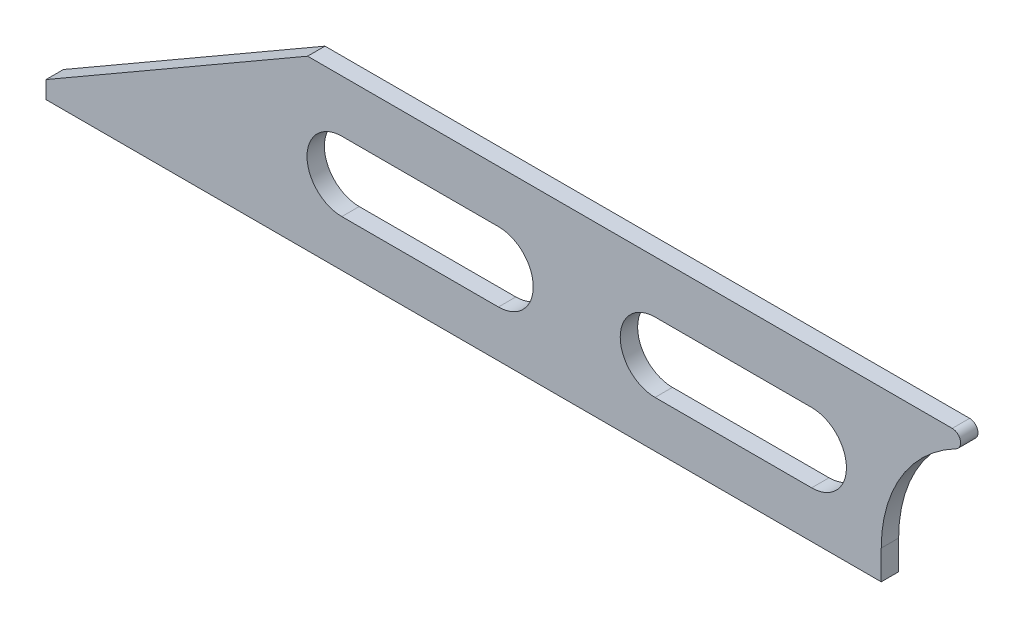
ISO-10303-21;
HEADER;
FILE_DESCRIPTION(('STEP AP214'),'2;1');
FILE_NAME('part.step','',(''),(''),'','','');
FILE_SCHEMA(('AUTOMOTIVE_DESIGN { 1 0 10303 214 1 1 1 1 }'));
ENDSEC;
DATA;
#1=APPLICATION_CONTEXT('core data for automotive mechanical design processes');
#2=APPLICATION_PROTOCOL_DEFINITION('international standard','automotive_design',2000,#1);
#3=PRODUCT_CONTEXT('',#1,'mechanical');
#4=PRODUCT('Part','Part','',(#3));
#5=PRODUCT_RELATED_PRODUCT_CATEGORY('part','',(#4));
#6=PRODUCT_DEFINITION_FORMATION('','',#4);
#7=PRODUCT_DEFINITION_CONTEXT('part definition',#1,'design');
#8=PRODUCT_DEFINITION('design','',#6,#7);
#9=PRODUCT_DEFINITION_SHAPE('','',#8);
#10=(LENGTH_UNIT() NAMED_UNIT(*) SI_UNIT(.MILLI.,.METRE.));
#11=(NAMED_UNIT(*) PLANE_ANGLE_UNIT() SI_UNIT($,.RADIAN.));
#12=(NAMED_UNIT(*) SI_UNIT($,.STERADIAN.) SOLID_ANGLE_UNIT());
#13=UNCERTAINTY_MEASURE_WITH_UNIT(LENGTH_MEASURE(1.E-05),#10,'distance_accuracy_value','');
#14=(GEOMETRIC_REPRESENTATION_CONTEXT(3) GLOBAL_UNCERTAINTY_ASSIGNED_CONTEXT((#13)) GLOBAL_UNIT_ASSIGNED_CONTEXT((#10,
#11,#12)) REPRESENTATION_CONTEXT('',''));
#15=CARTESIAN_POINT('',(0.,0.,0.));
#16=DIRECTION('',(0.,0.,1.));
#17=DIRECTION('',(1.,0.,0.));
#18=AXIS2_PLACEMENT_3D('',#15,#16,#17);
#19=CARTESIAN_POINT('',(304.8,61.4680000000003,3.17500000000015));
#20=DIRECTION('',(-1.,0.,0.));
#21=DIRECTION('',(0.,0.,1.));
#22=AXIS2_PLACEMENT_3D('',#19,#20,#21);
#23=PLANE('',#22);
#24=DIRECTION('',(0.,0.,1.));
#25=VECTOR('',#24,1.);
#26=CARTESIAN_POINT('',(304.799999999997,10.6680000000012,-75.0170489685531));
#27=LINE('',#26,#25);
#28=CARTESIAN_POINT('',(304.8,10.6680000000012,-3.17499999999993));
#29=VERTEX_POINT('',#28);
#30=CARTESIAN_POINT('',(304.8,10.6680000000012,3.17500000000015));
#31=VERTEX_POINT('',#30);
#32=EDGE_CURVE('E256',#29,#31,#27,.T.);
#33=ORIENTED_EDGE('',*,*,#32,.T.);
#34=DIRECTION('',(0.,1.,0.));
#35=VECTOR('',#34,1.);
#36=CARTESIAN_POINT('',(304.8,61.4680000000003,3.17500000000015));
#37=LINE('',#36,#35);
#38=CARTESIAN_POINT('',(304.8,4.44089209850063E-13,3.17500000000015));
#39=VERTEX_POINT('',#38);
#40=EDGE_CURVE('E220',#39,#31,#37,.T.);
#41=ORIENTED_EDGE('',*,*,#40,.F.);
#42=DIRECTION('',(0.,0.,-1.));
#43=VECTOR('',#42,1.);
#44=CARTESIAN_POINT('',(304.8,4.44089209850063E-13,3.17500000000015));
#45=LINE('',#44,#43);
#46=CARTESIAN_POINT('',(304.8,4.44089209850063E-13,-3.17499999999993));
#47=VERTEX_POINT('',#46);
#48=EDGE_CURVE('E238',#39,#47,#45,.T.);
#49=ORIENTED_EDGE('',*,*,#48,.T.);
#50=DIRECTION('',(0.,1.,0.));
#51=VECTOR('',#50,1.);
#52=CARTESIAN_POINT('',(304.8,61.4680000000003,-3.17499999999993));
#53=LINE('',#52,#51);
#54=EDGE_CURVE('E209',#47,#29,#53,.T.);
#55=ORIENTED_EDGE('',*,*,#54,.T.);
#56=EDGE_LOOP('',(#33,#41,#49,#55));
#57=FACE_BOUND('',#56,.T.);
#58=ADVANCED_FACE('F26',(#57),#23,.F.);
#59=CARTESIAN_POINT('',(304.8,4.44089209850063E-13,3.17500000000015));
#60=DIRECTION('',(0.,1.,0.));
#61=DIRECTION('',(-1.,0.,0.));
#62=AXIS2_PLACEMENT_3D('',#59,#60,#61);
#63=PLANE('',#62);
#64=DIRECTION('',(1.,0.,0.));
#65=VECTOR('',#64,1.);
#66=CARTESIAN_POINT('',(304.8,4.44089209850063E-13,-3.17499999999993));
#67=LINE('',#66,#65);
#68=CARTESIAN_POINT('',(0.,0.,-3.17499999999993));
#69=VERTEX_POINT('',#68);
#70=EDGE_CURVE('E200',#69,#47,#67,.T.);
#71=ORIENTED_EDGE('',*,*,#70,.T.);
#72=ORIENTED_EDGE('',*,*,#48,.F.);
#73=DIRECTION('',(1.,0.,0.));
#74=VECTOR('',#73,1.);
#75=CARTESIAN_POINT('',(304.8,4.44089209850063E-13,3.17500000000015));
#76=LINE('',#75,#74);
#77=CARTESIAN_POINT('',(0.,0.,3.17499999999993));
#78=VERTEX_POINT('',#77);
#79=EDGE_CURVE('E217',#78,#39,#76,.T.);
#80=ORIENTED_EDGE('',*,*,#79,.F.);
#81=DIRECTION('',(0.,0.,-1.));
#82=VECTOR('',#81,1.);
#83=CARTESIAN_POINT('',(0.,0.,3.17499999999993));
#84=LINE('',#83,#82);
#85=EDGE_CURVE('E229',#78,#69,#84,.T.);
#86=ORIENTED_EDGE('',*,*,#85,.T.);
#87=EDGE_LOOP('',(#71,#72,#80,#86));
#88=FACE_BOUND('',#87,.T.);
#89=ADVANCED_FACE('F28',(#88),#63,.F.);
#90=CARTESIAN_POINT('',(95.4671764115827,61.4680000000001,3.17500000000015));
#91=DIRECTION('',(0.,-1.,0.));
#92=DIRECTION('',(0.,0.,-1.));
#93=AXIS2_PLACEMENT_3D('',#90,#91,#92);
#94=PLANE('',#93);
#95=DIRECTION('',(-1.,0.,0.));
#96=VECTOR('',#95,1.);
#97=CARTESIAN_POINT('',(95.4671764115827,61.4680000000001,3.17500000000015));
#98=LINE('',#97,#96);
#99=CARTESIAN_POINT('',(330.713184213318,61.4680000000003,3.17499999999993));
#100=VERTEX_POINT('',#99);
#101=CARTESIAN_POINT('',(95.4671764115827,61.4680000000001,3.17500000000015));
#102=VERTEX_POINT('',#101);
#103=EDGE_CURVE('E223',#100,#102,#98,.T.);
#104=ORIENTED_EDGE('',*,*,#103,.F.);
#105=DIRECTION('',(0.,0.,-1.));
#106=VECTOR('',#105,1.);
#107=CARTESIAN_POINT('',(330.713184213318,61.4680000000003,-3.17499999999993));
#108=LINE('',#107,#106);
#109=CARTESIAN_POINT('',(330.713184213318,61.4680000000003,-3.17499999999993));
#110=VERTEX_POINT('',#109);
#111=EDGE_CURVE('E34',#100,#110,#108,.T.);
#112=ORIENTED_EDGE('',*,*,#111,.T.);
#113=DIRECTION('',(-1.,0.,0.));
#114=VECTOR('',#113,1.);
#115=CARTESIAN_POINT('',(95.4671764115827,61.4680000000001,-3.17499999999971));
#116=LINE('',#115,#114);
#117=CARTESIAN_POINT('',(95.4671764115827,61.4680000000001,-3.17499999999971));
#118=VERTEX_POINT('',#117);
#119=EDGE_CURVE('E211',#110,#118,#116,.T.);
#120=ORIENTED_EDGE('',*,*,#119,.T.);
#121=DIRECTION('',(0.,0.,-1.));
#122=VECTOR('',#121,1.);
#123=CARTESIAN_POINT('',(95.4671764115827,61.4680000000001,3.17500000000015));
#124=LINE('',#123,#122);
#125=EDGE_CURVE('E235',#102,#118,#124,.T.);
#126=ORIENTED_EDGE('',*,*,#125,.F.);
#127=EDGE_LOOP('',(#104,#112,#120,#126));
#128=FACE_BOUND('',#127,.T.);
#129=ADVANCED_FACE('F288',(#128),#94,.F.);
#130=CARTESIAN_POINT('',(0.,6.35000000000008,3.17499999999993));
#131=DIRECTION('',(0.499999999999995,-0.866025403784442,0.));
#132=DIRECTION('',(0.866025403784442,0.499999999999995,0.));
#133=AXIS2_PLACEMENT_3D('',#130,#131,#132);
#134=PLANE('',#133);
#135=DIRECTION('',(-0.866025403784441,-0.499999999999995,0.));
#136=VECTOR('',#135,1.);
#137=CARTESIAN_POINT('',(0.,6.35000000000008,-3.17500000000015));
#138=LINE('',#137,#136);
#139=CARTESIAN_POINT('',(0.,6.35000000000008,-3.17500000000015));
#140=VERTEX_POINT('',#139);
#141=EDGE_CURVE('E213',#118,#140,#138,.T.);
#142=ORIENTED_EDGE('',*,*,#141,.T.);
#143=DIRECTION('',(0.,0.,-1.));
#144=VECTOR('',#143,1.);
#145=CARTESIAN_POINT('',(0.,6.35000000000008,3.17499999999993));
#146=LINE('',#145,#144);
#147=CARTESIAN_POINT('',(0.,6.35000000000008,3.17499999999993));
#148=VERTEX_POINT('',#147);
#149=EDGE_CURVE('E232',#148,#140,#146,.T.);
#150=ORIENTED_EDGE('',*,*,#149,.F.);
#151=DIRECTION('',(-0.866025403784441,-0.499999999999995,0.));
#152=VECTOR('',#151,1.);
#153=CARTESIAN_POINT('',(0.,6.35000000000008,3.17499999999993));
#154=LINE('',#153,#152);
#155=EDGE_CURVE('E225',#102,#148,#154,.T.);
#156=ORIENTED_EDGE('',*,*,#155,.F.);
#157=ORIENTED_EDGE('',*,*,#125,.T.);
#158=EDGE_LOOP('',(#142,#150,#156,#157));
#159=FACE_BOUND('',#158,.T.);
#160=ADVANCED_FACE('F293',(#159),#134,.F.);
#161=CARTESIAN_POINT('',(0.,0.,3.17499999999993));
#162=DIRECTION('',(1.,0.,0.));
#163=DIRECTION('',(0.,0.,-1.));
#164=AXIS2_PLACEMENT_3D('',#161,#162,#163);
#165=PLANE('',#164);
#166=DIRECTION('',(0.,-1.,0.));
#167=VECTOR('',#166,1.);
#168=CARTESIAN_POINT('',(0.,0.,-3.17499999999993));
#169=LINE('',#168,#167);
#170=EDGE_CURVE('E215',#140,#69,#169,.T.);
#171=ORIENTED_EDGE('',*,*,#170,.T.);
#172=ORIENTED_EDGE('',*,*,#85,.F.);
#173=DIRECTION('',(0.,-1.,0.));
#174=VECTOR('',#173,1.);
#175=CARTESIAN_POINT('',(0.,0.,3.17499999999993));
#176=LINE('',#175,#174);
#177=EDGE_CURVE('E227',#148,#78,#176,.T.);
#178=ORIENTED_EDGE('',*,*,#177,.F.);
#179=ORIENTED_EDGE('',*,*,#149,.T.);
#180=EDGE_LOOP('',(#171,#172,#178,#179));
#181=FACE_BOUND('',#180,.T.);
#182=ADVANCED_FACE('F296',(#181),#165,.F.);
#183=CARTESIAN_POINT('',(0.,0.,3.17499999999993));
#184=DIRECTION('',(0.,0.,-1.));
#185=DIRECTION('',(-1.,0.,0.));
#186=AXIS2_PLACEMENT_3D('',#183,#184,#185);
#187=PLANE('',#186);
#188=DIRECTION('',(-1.,0.,0.));
#189=VECTOR('',#188,1.);
#190=CARTESIAN_POINT('',(165.1,42.4180000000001,3.17500000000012));
#191=LINE('',#190,#189);
#192=CARTESIAN_POINT('',(165.1,42.4180000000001,3.17500000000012));
#193=VERTEX_POINT('',#192);
#194=CARTESIAN_POINT('',(107.95,42.4180000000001,3.17500000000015));
#195=VERTEX_POINT('',#194);
#196=EDGE_CURVE('E147',#193,#195,#191,.T.);
#197=ORIENTED_EDGE('',*,*,#196,.F.);
#198=CARTESIAN_POINT('',(165.1,29.7180000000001,3.17500000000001));
#199=DIRECTION('',(0.,0.,1.));
#200=DIRECTION('',(-1.,0.,0.));
#201=AXIS2_PLACEMENT_3D('',#198,#199,#200);
#202=CIRCLE('',#201,12.7);
#203=CARTESIAN_POINT('',(165.1,17.018,3.17500000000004));
#204=VERTEX_POINT('',#203);
#205=EDGE_CURVE('E151',#204,#193,#202,.T.);
#206=ORIENTED_EDGE('',*,*,#205,.F.);
#207=DIRECTION('',(1.,0.,0.));
#208=VECTOR('',#207,1.);
#209=CARTESIAN_POINT('',(165.1,17.018,3.17500000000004));
#210=LINE('',#209,#208);
#211=CARTESIAN_POINT('',(107.95,17.018,3.17500000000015));
#212=VERTEX_POINT('',#211);
#213=EDGE_CURVE('E156',#212,#204,#210,.T.);
#214=ORIENTED_EDGE('',*,*,#213,.F.);
#215=CARTESIAN_POINT('',(107.95,29.7179999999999,3.17500000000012));
#216=DIRECTION('',(0.,0.,1.));
#217=DIRECTION('',(1.,0.,0.));
#218=AXIS2_PLACEMENT_3D('',#215,#216,#217);
#219=CIRCLE('',#218,12.7);
#220=EDGE_CURVE('E135',#195,#212,#219,.T.);
#221=ORIENTED_EDGE('',*,*,#220,.F.);
#222=EDGE_LOOP('',(#197,#206,#214,#221));
#223=FACE_BOUND('',#222,.T.);
#224=DIRECTION('',(-1.,0.,0.));
#225=VECTOR('',#224,1.);
#226=CARTESIAN_POINT('',(279.4,42.4180000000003,3.17500000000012));
#227=LINE('',#226,#225);
#228=CARTESIAN_POINT('',(279.4,42.4180000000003,3.17500000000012));
#229=VERTEX_POINT('',#228);
#230=CARTESIAN_POINT('',(222.25,42.4180000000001,3.17500000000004));
#231=VERTEX_POINT('',#230);
#232=EDGE_CURVE('E176',#229,#231,#227,.T.);
#233=ORIENTED_EDGE('',*,*,#232,.F.);
#234=CARTESIAN_POINT('',(279.4,29.7180000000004,3.17500000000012));
#235=DIRECTION('',(0.,0.,1.));
#236=DIRECTION('',(-1.,0.,0.));
#237=AXIS2_PLACEMENT_3D('',#234,#235,#236);
#238=CIRCLE('',#237,12.7);
#239=CARTESIAN_POINT('',(279.4,17.0180000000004,3.17500000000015));
#240=VERTEX_POINT('',#239);
#241=EDGE_CURVE('E172',#240,#229,#238,.T.);
#242=ORIENTED_EDGE('',*,*,#241,.F.);
#243=DIRECTION('',(1.,0.,0.));
#244=VECTOR('',#243,1.);
#245=CARTESIAN_POINT('',(279.4,17.0180000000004,3.17500000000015));
#246=LINE('',#245,#244);
#247=CARTESIAN_POINT('',(222.25,17.018,3.17499999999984));
#248=VERTEX_POINT('',#247);
#249=EDGE_CURVE('E182',#248,#240,#246,.T.);
#250=ORIENTED_EDGE('',*,*,#249,.F.);
#251=CARTESIAN_POINT('',(222.25,29.7180000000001,3.17500000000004));
#252=DIRECTION('',(0.,0.,1.));
#253=DIRECTION('',(1.,0.,0.));
#254=AXIS2_PLACEMENT_3D('',#251,#252,#253);
#255=CIRCLE('',#254,12.7);
#256=EDGE_CURVE('E179',#231,#248,#255,.T.);
#257=ORIENTED_EDGE('',*,*,#256,.F.);
#258=EDGE_LOOP('',(#233,#242,#250,#257));
#259=FACE_BOUND('',#258,.T.);
#260=CARTESIAN_POINT('',(355.599999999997,10.6680000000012,3.17499999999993));
#261=DIRECTION('',(0.,0.,-1.));
#262=DIRECTION('',(1.,0.,0.));
#263=AXIS2_PLACEMENT_3D('',#260,#261,#262);
#264=CIRCLE('',#263,50.8);
#265=CARTESIAN_POINT('',(332.121871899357,55.7170566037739,3.17499999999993));
#266=VERTEX_POINT('',#265);
#267=EDGE_CURVE('E250',#31,#266,#264,.T.);
#268=ORIENTED_EDGE('',*,*,#267,.T.);
#269=CARTESIAN_POINT('',(330.713184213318,58.4200000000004,3.17499999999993));
#270=DIRECTION('',(0.,0.,-1.));
#271=DIRECTION('',(-1.,0.,0.));
#272=AXIS2_PLACEMENT_3D('',#269,#270,#271);
#273=CIRCLE('',#272,3.048);
#274=EDGE_CURVE('E48',#266,#100,#273,.F.);
#275=ORIENTED_EDGE('',*,*,#274,.T.);
#276=ORIENTED_EDGE('',*,*,#103,.T.);
#277=ORIENTED_EDGE('',*,*,#155,.T.);
#278=ORIENTED_EDGE('',*,*,#177,.T.);
#279=ORIENTED_EDGE('',*,*,#79,.T.);
#280=ORIENTED_EDGE('',*,*,#40,.T.);
#281=EDGE_LOOP('',(#268,#275,#276,#277,#278,#279,#280));
#282=FACE_BOUND('',#281,.T.);
#283=ADVANCED_FACE('F153',(#223,#259,#282),#187,.F.);
#284=CARTESIAN_POINT('',(0.,0.,-3.17499999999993));
#285=DIRECTION('',(0.,0.,-1.));
#286=DIRECTION('',(-1.,0.,0.));
#287=AXIS2_PLACEMENT_3D('',#284,#285,#286);
#288=PLANE('',#287);
#289=CARTESIAN_POINT('',(165.1,29.7180000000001,-3.17499999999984));
#290=DIRECTION('',(0.,0.,1.));
#291=DIRECTION('',(-1.,0.,0.));
#292=AXIS2_PLACEMENT_3D('',#289,#290,#291);
#293=CIRCLE('',#292,12.7);
#294=CARTESIAN_POINT('',(165.1,17.018,-3.17499999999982));
#295=VERTEX_POINT('',#294);
#296=CARTESIAN_POINT('',(165.1,42.4180000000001,-3.17499999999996));
#297=VERTEX_POINT('',#296);
#298=EDGE_CURVE('E158',#295,#297,#293,.T.);
#299=ORIENTED_EDGE('',*,*,#298,.T.);
#300=DIRECTION('',(-1.,0.,0.));
#301=VECTOR('',#300,1.);
#302=CARTESIAN_POINT('',(165.1,42.4180000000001,-3.17499999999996));
#303=LINE('',#302,#301);
#304=CARTESIAN_POINT('',(107.95,42.4180000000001,-3.17499999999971));
#305=VERTEX_POINT('',#304);
#306=EDGE_CURVE('E164',#297,#305,#303,.T.);
#307=ORIENTED_EDGE('',*,*,#306,.T.);
#308=CARTESIAN_POINT('',(107.95,29.7179999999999,-3.17499999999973));
#309=DIRECTION('',(0.,0.,1.));
#310=DIRECTION('',(1.,0.,0.));
#311=AXIS2_PLACEMENT_3D('',#308,#309,#310);
#312=CIRCLE('',#311,12.7);
#313=CARTESIAN_POINT('',(107.95,17.018,-3.17499999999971));
#314=VERTEX_POINT('',#313);
#315=EDGE_CURVE('E138',#305,#314,#312,.T.);
#316=ORIENTED_EDGE('',*,*,#315,.T.);
#317=DIRECTION('',(1.,0.,0.));
#318=VECTOR('',#317,1.);
#319=CARTESIAN_POINT('',(165.1,17.018,-3.17499999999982));
#320=LINE('',#319,#318);
#321=EDGE_CURVE('E167',#314,#295,#320,.T.);
#322=ORIENTED_EDGE('',*,*,#321,.T.);
#323=EDGE_LOOP('',(#299,#307,#316,#322));
#324=FACE_BOUND('',#323,.T.);
#325=CARTESIAN_POINT('',(279.4,29.7180000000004,-3.17499999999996));
#326=DIRECTION('',(0.,0.,1.));
#327=DIRECTION('',(-1.,0.,0.));
#328=AXIS2_PLACEMENT_3D('',#325,#326,#327);
#329=CIRCLE('',#328,12.7);
#330=CARTESIAN_POINT('',(279.4,17.0180000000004,-3.17499999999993));
#331=VERTEX_POINT('',#330);
#332=CARTESIAN_POINT('',(279.4,42.4180000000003,-3.17499999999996));
#333=VERTEX_POINT('',#332);
#334=EDGE_CURVE('E185',#331,#333,#329,.T.);
#335=ORIENTED_EDGE('',*,*,#334,.T.);
#336=DIRECTION('',(-1.,0.,0.));
#337=VECTOR('',#336,1.);
#338=CARTESIAN_POINT('',(279.4,42.4180000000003,-3.17499999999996));
#339=LINE('',#338,#337);
#340=CARTESIAN_POINT('',(222.25,42.4180000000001,-3.17500000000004));
#341=VERTEX_POINT('',#340);
#342=EDGE_CURVE('E188',#333,#341,#339,.T.);
#343=ORIENTED_EDGE('',*,*,#342,.T.);
#344=CARTESIAN_POINT('',(222.25,29.7180000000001,-3.17500000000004));
#345=DIRECTION('',(0.,0.,1.));
#346=DIRECTION('',(1.,0.,0.));
#347=AXIS2_PLACEMENT_3D('',#344,#345,#346);
#348=CIRCLE('',#347,12.7);
#349=CARTESIAN_POINT('',(222.25,17.018,-3.17500000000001));
#350=VERTEX_POINT('',#349);
#351=EDGE_CURVE('E191',#341,#350,#348,.T.);
#352=ORIENTED_EDGE('',*,*,#351,.T.);
#353=DIRECTION('',(1.,0.,0.));
#354=VECTOR('',#353,1.);
#355=CARTESIAN_POINT('',(279.4,17.0180000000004,-3.17499999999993));
#356=LINE('',#355,#354);
#357=EDGE_CURVE('E194',#350,#331,#356,.T.);
#358=ORIENTED_EDGE('',*,*,#357,.T.);
#359=EDGE_LOOP('',(#335,#343,#352,#358));
#360=FACE_BOUND('',#359,.T.);
#361=ORIENTED_EDGE('',*,*,#119,.F.);
#362=CARTESIAN_POINT('',(330.713184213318,58.4200000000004,-3.17499999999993));
#363=DIRECTION('',(0.,0.,-1.));
#364=DIRECTION('',(-1.,0.,0.));
#365=AXIS2_PLACEMENT_3D('',#362,#363,#364);
#366=CIRCLE('',#365,3.048);
#367=CARTESIAN_POINT('',(332.121871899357,55.7170566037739,-3.17499999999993));
#368=VERTEX_POINT('',#367);
#369=EDGE_CURVE('E11',#110,#368,#366,.T.);
#370=ORIENTED_EDGE('',*,*,#369,.T.);
#371=CARTESIAN_POINT('',(355.599999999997,10.6680000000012,-3.17500000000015));
#372=DIRECTION('',(0.,0.,-1.));
#373=DIRECTION('',(-1.,0.,0.));
#374=AXIS2_PLACEMENT_3D('',#371,#372,#373);
#375=CIRCLE('',#374,50.8);
#376=EDGE_CURVE('E252',#29,#368,#375,.T.);
#377=ORIENTED_EDGE('',*,*,#376,.F.);
#378=ORIENTED_EDGE('',*,*,#54,.F.);
#379=ORIENTED_EDGE('',*,*,#70,.F.);
#380=ORIENTED_EDGE('',*,*,#170,.F.);
#381=ORIENTED_EDGE('',*,*,#141,.F.);
#382=EDGE_LOOP('',(#361,#370,#377,#378,#379,#380,#381));
#383=FACE_BOUND('',#382,.T.);
#384=ADVANCED_FACE('F266',(#324,#360,#383),#288,.T.);
#385=CARTESIAN_POINT('',(279.4,29.7180000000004,-3.17499999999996));
#386=DIRECTION('',(0.,0.,1.));
#387=DIRECTION('',(1.,0.,0.));
#388=AXIS2_PLACEMENT_3D('',#385,#386,#387);
#389=CYLINDRICAL_SURFACE('',#388,12.7);
#390=ORIENTED_EDGE('',*,*,#241,.T.);
#391=DIRECTION('',(0.,0.,1.));
#392=VECTOR('',#391,1.);
#393=CARTESIAN_POINT('',(279.4,42.4180000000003,-3.17499999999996));
#394=LINE('',#393,#392);
#395=EDGE_CURVE('E197',#333,#229,#394,.T.);
#396=ORIENTED_EDGE('',*,*,#395,.F.);
#397=ORIENTED_EDGE('',*,*,#334,.F.);
#398=DIRECTION('',(0.,0.,1.));
#399=VECTOR('',#398,1.);
#400=CARTESIAN_POINT('',(279.4,17.0180000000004,-3.17499999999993));
#401=LINE('',#400,#399);
#402=EDGE_CURVE('E198',#331,#240,#401,.T.);
#403=ORIENTED_EDGE('',*,*,#402,.T.);
#404=EDGE_LOOP('',(#390,#396,#397,#403));
#405=FACE_BOUND('',#404,.T.);
#406=ADVANCED_FACE('F269',(#405),#389,.F.);
#407=CARTESIAN_POINT('',(279.4,17.0180000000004,-3.17499999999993));
#408=DIRECTION('',(0.,-1.,0.));
#409=DIRECTION('',(1.,0.,0.));
#410=AXIS2_PLACEMENT_3D('',#407,#408,#409);
#411=PLANE('',#410);
#412=ORIENTED_EDGE('',*,*,#249,.T.);
#413=ORIENTED_EDGE('',*,*,#402,.F.);
#414=ORIENTED_EDGE('',*,*,#357,.F.);
#415=DIRECTION('',(0.,0.,1.));
#416=VECTOR('',#415,1.);
#417=CARTESIAN_POINT('',(222.25,17.018,-3.17500000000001));
#418=LINE('',#417,#416);
#419=EDGE_CURVE('E201',#350,#248,#418,.T.);
#420=ORIENTED_EDGE('',*,*,#419,.T.);
#421=EDGE_LOOP('',(#412,#413,#414,#420));
#422=FACE_BOUND('',#421,.T.);
#423=ADVANCED_FACE('F305',(#422),#411,.F.);
#424=CARTESIAN_POINT('',(222.25,29.7180000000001,-3.17500000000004));
#425=DIRECTION('',(0.,0.,1.));
#426=DIRECTION('',(1.,0.,0.));
#427=AXIS2_PLACEMENT_3D('',#424,#425,#426);
#428=CYLINDRICAL_SURFACE('',#427,12.7);
#429=ORIENTED_EDGE('',*,*,#256,.T.);
#430=ORIENTED_EDGE('',*,*,#419,.F.);
#431=ORIENTED_EDGE('',*,*,#351,.F.);
#432=DIRECTION('',(0.,0.,1.));
#433=VECTOR('',#432,1.);
#434=CARTESIAN_POINT('',(222.25,42.4180000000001,-3.17500000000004));
#435=LINE('',#434,#433);
#436=EDGE_CURVE('E203',#341,#231,#435,.T.);
#437=ORIENTED_EDGE('',*,*,#436,.T.);
#438=EDGE_LOOP('',(#429,#430,#431,#437));
#439=FACE_BOUND('',#438,.T.);
#440=ADVANCED_FACE('F310',(#439),#428,.F.);
#441=CARTESIAN_POINT('',(279.4,42.4180000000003,-3.17499999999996));
#442=DIRECTION('',(0.,1.,0.));
#443=DIRECTION('',(0.,0.,1.));
#444=AXIS2_PLACEMENT_3D('',#441,#442,#443);
#445=PLANE('',#444);
#446=ORIENTED_EDGE('',*,*,#232,.T.);
#447=ORIENTED_EDGE('',*,*,#436,.F.);
#448=ORIENTED_EDGE('',*,*,#342,.F.);
#449=ORIENTED_EDGE('',*,*,#395,.T.);
#450=EDGE_LOOP('',(#446,#447,#448,#449));
#451=FACE_BOUND('',#450,.T.);
#452=ADVANCED_FACE('F307',(#451),#445,.F.);
#453=CARTESIAN_POINT('',(165.1,29.7180000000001,-3.17499999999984));
#454=DIRECTION('',(0.,0.,1.));
#455=DIRECTION('',(1.,0.,0.));
#456=AXIS2_PLACEMENT_3D('',#453,#454,#455);
#457=CYLINDRICAL_SURFACE('',#456,12.7);
#458=ORIENTED_EDGE('',*,*,#205,.T.);
#459=DIRECTION('',(0.,0.,1.));
#460=VECTOR('',#459,1.);
#461=CARTESIAN_POINT('',(165.1,42.4180000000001,-3.17499999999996));
#462=LINE('',#461,#460);
#463=EDGE_CURVE('E143',#297,#193,#462,.T.);
#464=ORIENTED_EDGE('',*,*,#463,.F.);
#465=ORIENTED_EDGE('',*,*,#298,.F.);
#466=DIRECTION('',(0.,0.,1.));
#467=VECTOR('',#466,1.);
#468=CARTESIAN_POINT('',(165.1,17.018,-3.17499999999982));
#469=LINE('',#468,#467);
#470=EDGE_CURVE('E170',#295,#204,#469,.T.);
#471=ORIENTED_EDGE('',*,*,#470,.T.);
#472=EDGE_LOOP('',(#458,#464,#465,#471));
#473=FACE_BOUND('',#472,.T.);
#474=ADVANCED_FACE('F260',(#473),#457,.F.);
#475=CARTESIAN_POINT('',(165.1,17.018,-3.17499999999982));
#476=DIRECTION('',(0.,-1.,0.));
#477=DIRECTION('',(1.,0.,0.));
#478=AXIS2_PLACEMENT_3D('',#475,#476,#477);
#479=PLANE('',#478);
#480=ORIENTED_EDGE('',*,*,#213,.T.);
#481=ORIENTED_EDGE('',*,*,#470,.F.);
#482=ORIENTED_EDGE('',*,*,#321,.F.);
#483=DIRECTION('',(0.,0.,1.));
#484=VECTOR('',#483,1.);
#485=CARTESIAN_POINT('',(107.95,17.018,-3.17499999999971));
#486=LINE('',#485,#484);
#487=EDGE_CURVE('E142',#314,#212,#486,.T.);
#488=ORIENTED_EDGE('',*,*,#487,.T.);
#489=EDGE_LOOP('',(#480,#481,#482,#488));
#490=FACE_BOUND('',#489,.T.);
#491=ADVANCED_FACE('F264',(#490),#479,.F.);
#492=CARTESIAN_POINT('',(107.95,29.7179999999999,-3.17499999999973));
#493=DIRECTION('',(0.,0.,1.));
#494=DIRECTION('',(1.,0.,0.));
#495=AXIS2_PLACEMENT_3D('',#492,#493,#494);
#496=CYLINDRICAL_SURFACE('',#495,12.7);
#497=ORIENTED_EDGE('',*,*,#220,.T.);
#498=ORIENTED_EDGE('',*,*,#487,.F.);
#499=ORIENTED_EDGE('',*,*,#315,.F.);
#500=DIRECTION('',(0.,0.,1.));
#501=VECTOR('',#500,1.);
#502=CARTESIAN_POINT('',(107.95,42.4180000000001,-3.17499999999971));
#503=LINE('',#502,#501);
#504=EDGE_CURVE('E131',#305,#195,#503,.T.);
#505=ORIENTED_EDGE('',*,*,#504,.T.);
#506=EDGE_LOOP('',(#497,#498,#499,#505));
#507=FACE_BOUND('',#506,.T.);
#508=ADVANCED_FACE('F133',(#507),#496,.F.);
#509=CARTESIAN_POINT('',(165.1,42.4180000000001,-3.17499999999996));
#510=DIRECTION('',(0.,1.,0.));
#511=DIRECTION('',(0.,0.,1.));
#512=AXIS2_PLACEMENT_3D('',#509,#510,#511);
#513=PLANE('',#512);
#514=ORIENTED_EDGE('',*,*,#196,.T.);
#515=ORIENTED_EDGE('',*,*,#504,.F.);
#516=ORIENTED_EDGE('',*,*,#306,.F.);
#517=ORIENTED_EDGE('',*,*,#463,.T.);
#518=EDGE_LOOP('',(#514,#515,#516,#517));
#519=FACE_BOUND('',#518,.T.);
#520=ADVANCED_FACE('F148',(#519),#513,.F.);
#521=CARTESIAN_POINT('',(355.599999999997,10.668000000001,-75.0170489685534));
#522=DIRECTION('',(0.,0.,1.));
#523=DIRECTION('',(1.,0.,0.));
#524=AXIS2_PLACEMENT_3D('',#521,#522,#523);
#525=CYLINDRICAL_SURFACE('',#524,50.8);
#526=ORIENTED_EDGE('',*,*,#376,.T.);
#527=DIRECTION('',(0.,0.,1.));
#528=VECTOR('',#527,1.);
#529=CARTESIAN_POINT('',(332.121871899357,55.7170566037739,-75.0170489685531));
#530=LINE('',#529,#528);
#531=EDGE_CURVE('E241',#368,#266,#530,.T.);
#532=ORIENTED_EDGE('',*,*,#531,.T.);
#533=ORIENTED_EDGE('',*,*,#267,.F.);
#534=ORIENTED_EDGE('',*,*,#32,.F.);
#535=EDGE_LOOP('',(#526,#532,#533,#534));
#536=FACE_BOUND('',#535,.T.);
#537=ADVANCED_FACE('F248',(#536),#525,.F.);
#538=CARTESIAN_POINT('',(330.713184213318,58.4200000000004,-75.0170489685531));
#539=DIRECTION('',(0.,0.,1.));
#540=DIRECTION('',(1.,0.,0.));
#541=AXIS2_PLACEMENT_3D('',#538,#539,#540);
#542=CYLINDRICAL_SURFACE('',#541,3.048);
#543=ORIENTED_EDGE('',*,*,#369,.F.);
#544=ORIENTED_EDGE('',*,*,#111,.F.);
#545=ORIENTED_EDGE('',*,*,#274,.F.);
#546=ORIENTED_EDGE('',*,*,#531,.F.);
#547=EDGE_LOOP('',(#543,#544,#545,#546));
#548=FACE_BOUND('',#547,.T.);
#549=ADVANCED_FACE('F276',(#548),#542,.T.);
#550=CLOSED_SHELL('',(#58,#89,#129,#160,#182,#283,#384,#406,#423,#440,#452,#474,#491,#508,#520,
#537,#549));
#551=MANIFOLD_SOLID_BREP('B2',#550);
#552=ADVANCED_BREP_SHAPE_REPRESENTATION('',(#18,#551),#14);
#553=SHAPE_DEFINITION_REPRESENTATION(#9,#552);
ENDSEC;
END-ISO-10303-21;
